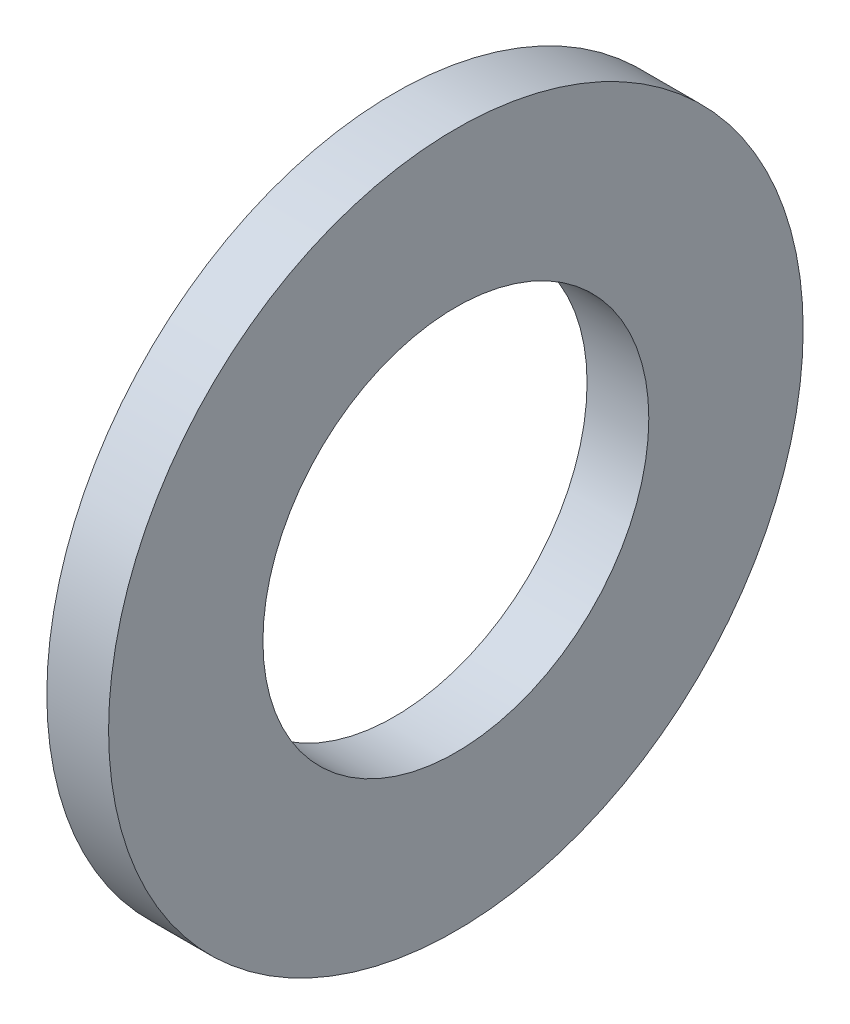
from build123d import *

# Parameters (mm, degrees)
ESQUISSE1_W = 4
ESQUISSE1_H = 10


with BuildPart() as part:
    # Esquisse1 → Base-R_volution (revolve)
    with BuildSketch(Plane(origin=(0, 0, 0), x_dir=(1, 0, 0), z_dir=(0, 1, 0)), mode=Mode.PRIVATE) as base_r_volution_sk:
        with Locations((2, 17.5)):
            Rectangle(ESQUISSE1_W, ESQUISSE1_H)
    revolve(base_r_volution_sk.sketch.rotate(Axis((0, 0, 0), (1, 0, 0)), 180), axis=Axis((0, 0, 0), (1, 0, 0)))


solid = part.part
